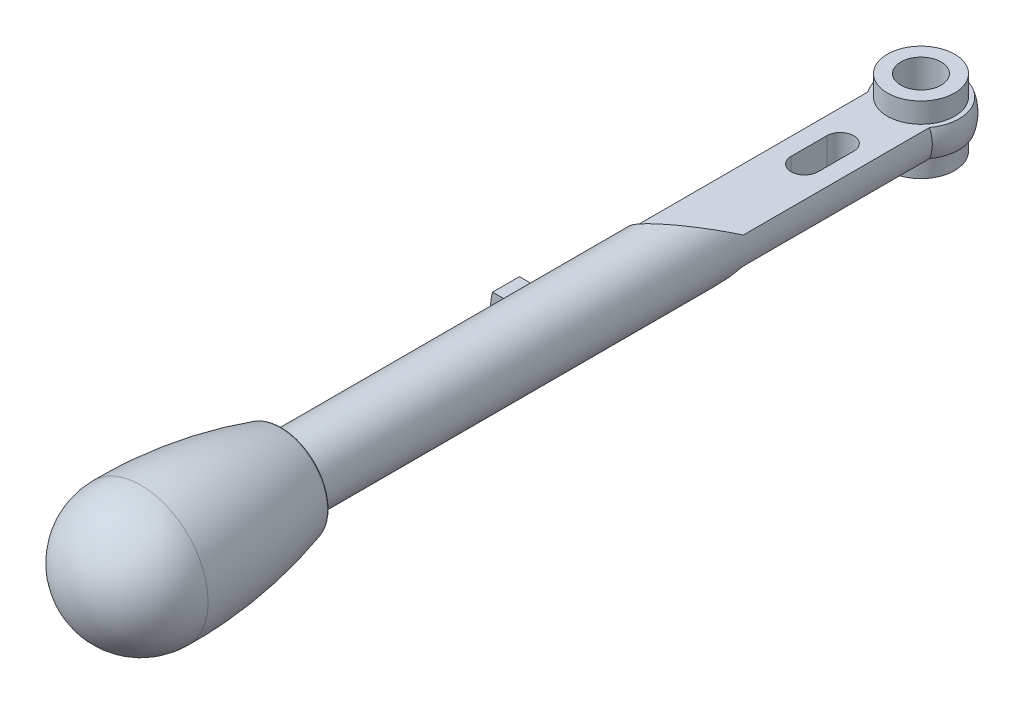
ISO-10303-21;
HEADER;
FILE_DESCRIPTION(('STEP AP214'),'2;1');
FILE_NAME('part.step','',(''),(''),'','','');
FILE_SCHEMA(('AUTOMOTIVE_DESIGN { 1 0 10303 214 1 1 1 1 }'));
ENDSEC;
DATA;
#1=APPLICATION_CONTEXT('core data for automotive mechanical design processes');
#2=APPLICATION_PROTOCOL_DEFINITION('international standard','automotive_design',2000,#1);
#3=PRODUCT_CONTEXT('',#1,'mechanical');
#4=PRODUCT('Part','Part','',(#3));
#5=PRODUCT_RELATED_PRODUCT_CATEGORY('part','',(#4));
#6=PRODUCT_DEFINITION_FORMATION('','',#4);
#7=PRODUCT_DEFINITION_CONTEXT('part definition',#1,'design');
#8=PRODUCT_DEFINITION('design','',#6,#7);
#9=PRODUCT_DEFINITION_SHAPE('','',#8);
#10=(LENGTH_UNIT() NAMED_UNIT(*) SI_UNIT(.MILLI.,.METRE.));
#11=(NAMED_UNIT(*) PLANE_ANGLE_UNIT() SI_UNIT($,.RADIAN.));
#12=(NAMED_UNIT(*) SI_UNIT($,.STERADIAN.) SOLID_ANGLE_UNIT());
#13=UNCERTAINTY_MEASURE_WITH_UNIT(LENGTH_MEASURE(1.E-05),#10,'distance_accuracy_value','');
#14=(GEOMETRIC_REPRESENTATION_CONTEXT(3) GLOBAL_UNCERTAINTY_ASSIGNED_CONTEXT((#13)) GLOBAL_UNIT_ASSIGNED_CONTEXT((#10,
#11,#12)) REPRESENTATION_CONTEXT('',''));
#15=CARTESIAN_POINT('',(0.,0.,0.));
#16=DIRECTION('',(0.,0.,1.));
#17=DIRECTION('',(1.,0.,0.));
#18=AXIS2_PLACEMENT_3D('',#15,#16,#17);
#19=CARTESIAN_POINT('',(5.5927492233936,-3.55678978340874,95.));
#20=DIRECTION('',(0.,0.,1.));
#21=DIRECTION('',(-0.536635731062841,-0.843814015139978,0.));
#22=AXIS2_PLACEMENT_3D('',#19,#20,#21);
#23=PLANE('',#22);
#24=CARTESIAN_POINT('',(0.,0.,95.));
#25=DIRECTION('',(0.,0.,-1.));
#26=DIRECTION('',(0.536635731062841,0.843814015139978,0.));
#27=AXIS2_PLACEMENT_3D('',#24,#25,#26);
#28=CIRCLE('',#27,6.62794066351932);
#29=CARTESIAN_POINT('',(3.55678978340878,5.59274922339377,95.));
#30=VERTEX_POINT('',#29);
#31=EDGE_CURVE('E146',#30,#30,#28,.T.);
#32=ORIENTED_EDGE('',*,*,#31,.T.);
#33=EDGE_LOOP('',(#32));
#34=FACE_BOUND('',#33,.T.);
#35=CARTESIAN_POINT('',(0.,0.,95.));
#36=DIRECTION('',(0.,0.,-1.));
#37=DIRECTION('',(0.,-1.,0.));
#38=AXIS2_PLACEMENT_3D('',#35,#36,#37);
#39=CIRCLE('',#38,5.);
#40=CARTESIAN_POINT('',(0.,-5.,95.));
#41=VERTEX_POINT('',#40);
#42=EDGE_CURVE('E9',#41,#41,#39,.T.);
#43=ORIENTED_EDGE('',*,*,#42,.F.);
#44=EDGE_LOOP('',(#43));
#45=FACE_BOUND('',#44,.T.);
#46=ADVANCED_FACE('F14',(#34,#45),#23,.F.);
#47=CARTESIAN_POINT('',(0.,0.,116.));
#48=DIRECTION('',(0.536635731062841,0.843814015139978,0.));
#49=DIRECTION('',(0.,0.,1.));
#50=AXIS2_PLACEMENT_3D('',#47,#48,#49);
#51=SPHERICAL_SURFACE('',#50,10.);
#52=CARTESIAN_POINT('',(0.,0.,116.));
#53=DIRECTION('',(0.,0.,-1.));
#54=DIRECTION('',(0.536635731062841,0.843814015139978,0.));
#55=AXIS2_PLACEMENT_3D('',#52,#53,#54);
#56=SPHERICAL_SURFACE('',#55,10.);
#57=CARTESIAN_POINT('',(0.,0.,116.));
#58=DIRECTION('',(0.,0.,-1.));
#59=DIRECTION('',(0.536635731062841,0.843814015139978,0.));
#60=AXIS2_PLACEMENT_3D('',#57,#58,#59);
#61=CIRCLE('',#60,10.);
#62=CARTESIAN_POINT('',(5.36635731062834,8.43814015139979,116.));
#63=VERTEX_POINT('',#62);
#64=EDGE_CURVE('E24',#63,#63,#61,.T.);
#65=ORIENTED_EDGE('',*,*,#64,.F.);
#66=EDGE_LOOP('',(#65));
#67=FACE_BOUND('',#66,.T.);
#68=ADVANCED_FACE('F387',(#67),#56,.T.);
#69=CARTESIAN_POINT('',(0.,0.,115.285192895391));
#70=DIRECTION('',(0.,0.,-1.));
#71=DIRECTION('',(0.536635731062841,0.843814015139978,0.));
#72=AXIS2_PLACEMENT_3D('',#69,#70,#71);
#73=DEGENERATE_TOROIDAL_SURFACE('',#72,59.9963502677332,70.,.F.);
#74=CARTESIAN_POINT('',(0.,0.,95.3576604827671));
#75=DIRECTION('',(0.,0.,-1.));
#76=DIRECTION('',(0.536635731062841,0.843814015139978,0.));
#77=AXIS2_PLACEMENT_3D('',#74,#75,#76);
#78=CIRCLE('',#77,7.10725210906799);
#79=CARTESIAN_POINT('',(3.81400543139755,5.99719893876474,95.3576604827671));
#80=VERTEX_POINT('',#79);
#81=EDGE_CURVE('E406',#80,#80,#78,.T.);
#82=ORIENTED_EDGE('',*,*,#81,.F.);
#83=EDGE_LOOP('',(#82));
#84=FACE_BOUND('',#83,.T.);
#85=ORIENTED_EDGE('',*,*,#64,.T.);
#86=EDGE_LOOP('',(#85));
#87=FACE_BOUND('',#86,.T.);
#88=ADVANCED_FACE('F382',(#84,#87),#73,.F.);
#89=CARTESIAN_POINT('',(0.,0.,95.5));
#90=DIRECTION('',(0.,0.,-1.));
#91=DIRECTION('',(0.536635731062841,0.843814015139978,0.));
#92=AXIS2_PLACEMENT_3D('',#89,#90,#91);
#93=TOROIDAL_SURFACE('',#92,6.62794066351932,0.50000000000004);
#94=ORIENTED_EDGE('',*,*,#31,.F.);
#95=EDGE_LOOP('',(#94));
#96=FACE_BOUND('',#95,.T.);
#97=ORIENTED_EDGE('',*,*,#81,.T.);
#98=EDGE_LOOP('',(#97));
#99=FACE_BOUND('',#98,.T.);
#100=ADVANCED_FACE('F323',(#96,#99),#93,.T.);
#101=CARTESIAN_POINT('',(0.,5.,0.));
#102=DIRECTION('',(0.,1.,0.));
#103=DIRECTION('',(0.71733913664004,0.,-0.696724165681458));
#104=AXIS2_PLACEMENT_3D('',#101,#102,#103);
#105=PLANE('',#104);
#106=CARTESIAN_POINT('',(0.,5.,0.));
#107=DIRECTION('',(0.,1.,0.));
#108=DIRECTION('',(0.71733913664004,0.,-0.696724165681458));
#109=AXIS2_PLACEMENT_3D('',#106,#107,#108);
#110=CIRCLE('',#109,5.);
#111=CARTESIAN_POINT('',(3.5866956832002,5.,-3.48362082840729));
#112=VERTEX_POINT('',#111);
#113=EDGE_CURVE('E153',#112,#112,#110,.T.);
#114=ORIENTED_EDGE('',*,*,#113,.T.);
#115=EDGE_LOOP('',(#114));
#116=FACE_BOUND('',#115,.T.);
#117=CARTESIAN_POINT('',(0.,5.,0.));
#118=DIRECTION('',(0.,1.,0.));
#119=DIRECTION('',(-0.159471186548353,0.,0.987202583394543));
#120=AXIS2_PLACEMENT_3D('',#117,#118,#119);
#121=CIRCLE('',#120,3.);
#122=CARTESIAN_POINT('',(-0.478413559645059,5.,2.96160775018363));
#123=VERTEX_POINT('',#122);
#124=EDGE_CURVE('E415',#123,#123,#121,.T.);
#125=ORIENTED_EDGE('',*,*,#124,.F.);
#126=EDGE_LOOP('',(#125));
#127=FACE_BOUND('',#126,.T.);
#128=ADVANCED_FACE('F367',(#116,#127),#105,.T.);
#129=CARTESIAN_POINT('',(0.,-5.,0.));
#130=DIRECTION('',(0.,1.,0.));
#131=DIRECTION('',(0.71733913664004,0.,-0.696724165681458));
#132=AXIS2_PLACEMENT_3D('',#129,#130,#131);
#133=PLANE('',#132);
#134=CARTESIAN_POINT('',(0.,-5.,0.));
#135=DIRECTION('',(0.,1.,0.));
#136=DIRECTION('',(0.71733913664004,0.,-0.696724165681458));
#137=AXIS2_PLACEMENT_3D('',#134,#135,#136);
#138=CIRCLE('',#137,5.);
#139=CARTESIAN_POINT('',(3.5866956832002,-5.,-3.48362082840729));
#140=VERTEX_POINT('',#139);
#141=EDGE_CURVE('E241',#140,#140,#138,.T.);
#142=ORIENTED_EDGE('',*,*,#141,.F.);
#143=EDGE_LOOP('',(#142));
#144=FACE_BOUND('',#143,.T.);
#145=CARTESIAN_POINT('',(0.,-5.,0.));
#146=DIRECTION('',(0.,1.,0.));
#147=DIRECTION('',(-0.159471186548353,0.,0.987202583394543));
#148=AXIS2_PLACEMENT_3D('',#145,#146,#147);
#149=CIRCLE('',#148,3.);
#150=CARTESIAN_POINT('',(-0.478413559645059,-5.,2.96160775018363));
#151=VERTEX_POINT('',#150);
#152=EDGE_CURVE('E244',#151,#151,#149,.F.);
#153=ORIENTED_EDGE('',*,*,#152,.F.);
#154=EDGE_LOOP('',(#153));
#155=FACE_BOUND('',#154,.T.);
#156=ADVANCED_FACE('F341',(#144,#155),#133,.F.);
#157=CARTESIAN_POINT('',(0.,5.,0.));
#158=DIRECTION('',(0.,-1.,0.));
#159=DIRECTION('',(-0.71733913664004,0.,0.696724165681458));
#160=AXIS2_PLACEMENT_3D('',#157,#158,#159);
#161=CYLINDRICAL_SURFACE('',#160,5.);
#162=ORIENTED_EDGE('',*,*,#113,.F.);
#163=EDGE_LOOP('',(#162));
#164=FACE_BOUND('',#163,.T.);
#165=CARTESIAN_POINT('',(0.,2.,0.));
#166=DIRECTION('',(0.,-1.,0.));
#167=DIRECTION('',(0.159471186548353,0.,-0.987202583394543));
#168=AXIS2_PLACEMENT_3D('',#165,#166,#167);
#169=CIRCLE('',#168,5.);
#170=CARTESIAN_POINT('',(0.797355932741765,2.,-4.93601291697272));
#171=VERTEX_POINT('',#170);
#172=EDGE_CURVE('E233',#171,#171,#169,.F.);
#173=ORIENTED_EDGE('',*,*,#172,.T.);
#174=EDGE_LOOP('',(#173));
#175=FACE_BOUND('',#174,.T.);
#176=ADVANCED_FACE('F290',(#164,#175),#161,.T.);
#177=CARTESIAN_POINT('',(0.,-2.,0.));
#178=DIRECTION('',(0.,-1.,0.));
#179=DIRECTION('',(-0.71733913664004,0.,0.696724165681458));
#180=AXIS2_PLACEMENT_3D('',#177,#178,#179);
#181=CYLINDRICAL_SURFACE('',#180,5.);
#182=CARTESIAN_POINT('',(0.,-2.,0.));
#183=DIRECTION('',(0.,1.,0.));
#184=DIRECTION('',(-0.159471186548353,0.,0.987202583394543));
#185=AXIS2_PLACEMENT_3D('',#182,#183,#184);
#186=CIRCLE('',#185,5.);
#187=CARTESIAN_POINT('',(-0.797355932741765,-2.,4.93601291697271));
#188=VERTEX_POINT('',#187);
#189=EDGE_CURVE('E236',#188,#188,#186,.F.);
#190=ORIENTED_EDGE('',*,*,#189,.T.);
#191=EDGE_LOOP('',(#190));
#192=FACE_BOUND('',#191,.T.);
#193=ORIENTED_EDGE('',*,*,#141,.T.);
#194=EDGE_LOOP('',(#193));
#195=FACE_BOUND('',#194,.T.);
#196=ADVANCED_FACE('F16',(#192,#195),#181,.T.);
#197=CARTESIAN_POINT('',(0.,-10.,17.3));
#198=DIRECTION('',(0.,1.,0.));
#199=DIRECTION('',(-1.,0.,0.));
#200=AXIS2_PLACEMENT_3D('',#197,#198,#199);
#201=CYLINDRICAL_SURFACE('',#200,2.);
#202=DIRECTION('',(0.,1.,0.));
#203=VECTOR('',#202,1.);
#204=CARTESIAN_POINT('',(-2.00000000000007,-10.,17.3));
#205=LINE('',#204,#203);
#206=CARTESIAN_POINT('',(-2.00000000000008,-2.,17.3));
#207=VERTEX_POINT('',#206);
#208=CARTESIAN_POINT('',(-2.00000000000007,2.,17.3));
#209=VERTEX_POINT('',#208);
#210=EDGE_CURVE('E107',#207,#209,#205,.T.);
#211=ORIENTED_EDGE('',*,*,#210,.T.);
#212=CARTESIAN_POINT('',(0.,2.,17.3));
#213=DIRECTION('',(0.,-1.,0.));
#214=DIRECTION('',(0.,0.,1.));
#215=AXIS2_PLACEMENT_3D('',#212,#213,#214);
#216=CIRCLE('',#215,2.);
#217=CARTESIAN_POINT('',(2.,2.,17.3));
#218=VERTEX_POINT('',#217);
#219=EDGE_CURVE('E224',#218,#209,#216,.T.);
#220=ORIENTED_EDGE('',*,*,#219,.F.);
#221=DIRECTION('',(0.,1.,0.));
#222=VECTOR('',#221,1.);
#223=CARTESIAN_POINT('',(2.,-10.,17.3));
#224=LINE('',#223,#222);
#225=CARTESIAN_POINT('',(2.,-2.,17.3));
#226=VERTEX_POINT('',#225);
#227=EDGE_CURVE('E186',#226,#218,#224,.T.);
#228=ORIENTED_EDGE('',*,*,#227,.F.);
#229=CARTESIAN_POINT('',(0.,-2.,17.3));
#230=DIRECTION('',(0.,1.,0.));
#231=DIRECTION('',(0.,0.,-1.));
#232=AXIS2_PLACEMENT_3D('',#229,#230,#231);
#233=CIRCLE('',#232,2.);
#234=EDGE_CURVE('E193',#207,#226,#233,.T.);
#235=ORIENTED_EDGE('',*,*,#234,.F.);
#236=EDGE_LOOP('',(#211,#220,#228,#235));
#237=FACE_BOUND('',#236,.T.);
#238=ADVANCED_FACE('F310',(#237),#201,.F.);
#239=CARTESIAN_POINT('',(-2.00000000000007,-10.,17.3));
#240=DIRECTION('',(-1.,0.,0.));
#241=DIRECTION('',(0.,0.,1.));
#242=AXIS2_PLACEMENT_3D('',#239,#240,#241);
#243=PLANE('',#242);
#244=DIRECTION('',(0.,1.,0.));
#245=VECTOR('',#244,1.);
#246=CARTESIAN_POINT('',(-2.00000000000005,-10.,12.));
#247=LINE('',#246,#245);
#248=CARTESIAN_POINT('',(-2.00000000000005,-2.,12.));
#249=VERTEX_POINT('',#248);
#250=CARTESIAN_POINT('',(-2.00000000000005,2.,12.));
#251=VERTEX_POINT('',#250);
#252=EDGE_CURVE('E102',#249,#251,#247,.T.);
#253=ORIENTED_EDGE('',*,*,#252,.T.);
#254=DIRECTION('',(0.,0.,-1.));
#255=VECTOR('',#254,1.);
#256=CARTESIAN_POINT('',(-2.00000000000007,2.,22.));
#257=LINE('',#256,#255);
#258=EDGE_CURVE('E221',#209,#251,#257,.T.);
#259=ORIENTED_EDGE('',*,*,#258,.F.);
#260=ORIENTED_EDGE('',*,*,#210,.F.);
#261=DIRECTION('',(0.,0.,1.));
#262=VECTOR('',#261,1.);
#263=CARTESIAN_POINT('',(-2.00000000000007,-2.,22.));
#264=LINE('',#263,#262);
#265=EDGE_CURVE('E185',#249,#207,#264,.T.);
#266=ORIENTED_EDGE('',*,*,#265,.F.);
#267=EDGE_LOOP('',(#253,#259,#260,#266));
#268=FACE_BOUND('',#267,.T.);
#269=ADVANCED_FACE('F316',(#268),#243,.F.);
#270=CARTESIAN_POINT('',(0.,-10.,12.));
#271=DIRECTION('',(0.,1.,0.));
#272=DIRECTION('',(-1.,0.,0.));
#273=AXIS2_PLACEMENT_3D('',#270,#271,#272);
#274=CYLINDRICAL_SURFACE('',#273,2.);
#275=DIRECTION('',(0.,1.,0.));
#276=VECTOR('',#275,1.);
#277=CARTESIAN_POINT('',(1.99999999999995,-10.,12.));
#278=LINE('',#277,#276);
#279=CARTESIAN_POINT('',(1.99999999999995,-2.,12.));
#280=VERTEX_POINT('',#279);
#281=CARTESIAN_POINT('',(1.99999999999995,2.,12.));
#282=VERTEX_POINT('',#281);
#283=EDGE_CURVE('E182',#280,#282,#278,.T.);
#284=ORIENTED_EDGE('',*,*,#283,.T.);
#285=CARTESIAN_POINT('',(0.,2.,12.));
#286=DIRECTION('',(0.,-1.,0.));
#287=DIRECTION('',(0.,0.,1.));
#288=AXIS2_PLACEMENT_3D('',#285,#286,#287);
#289=CIRCLE('',#288,2.);
#290=EDGE_CURVE('E230',#251,#282,#289,.T.);
#291=ORIENTED_EDGE('',*,*,#290,.F.);
#292=ORIENTED_EDGE('',*,*,#252,.F.);
#293=CARTESIAN_POINT('',(0.,-2.,12.));
#294=DIRECTION('',(0.,1.,0.));
#295=DIRECTION('',(0.,0.,-1.));
#296=AXIS2_PLACEMENT_3D('',#293,#294,#295);
#297=CIRCLE('',#296,2.);
#298=EDGE_CURVE('E199',#280,#249,#297,.T.);
#299=ORIENTED_EDGE('',*,*,#298,.F.);
#300=EDGE_LOOP('',(#284,#291,#292,#299));
#301=FACE_BOUND('',#300,.T.);
#302=ADVANCED_FACE('F326',(#301),#274,.F.);
#303=CARTESIAN_POINT('',(1.99999999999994,-10.,17.3));
#304=DIRECTION('',(1.,0.,0.));
#305=DIRECTION('',(0.,0.,-1.));
#306=AXIS2_PLACEMENT_3D('',#303,#304,#305);
#307=PLANE('',#306);
#308=ORIENTED_EDGE('',*,*,#227,.T.);
#309=DIRECTION('',(0.,0.,1.));
#310=VECTOR('',#309,1.);
#311=CARTESIAN_POINT('',(1.99999999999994,2.,22.));
#312=LINE('',#311,#310);
#313=EDGE_CURVE('E227',#282,#218,#312,.T.);
#314=ORIENTED_EDGE('',*,*,#313,.F.);
#315=ORIENTED_EDGE('',*,*,#283,.F.);
#316=DIRECTION('',(0.,0.,-1.));
#317=VECTOR('',#316,1.);
#318=CARTESIAN_POINT('',(1.99999999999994,-2.,22.));
#319=LINE('',#318,#317);
#320=EDGE_CURVE('E196',#226,#280,#319,.T.);
#321=ORIENTED_EDGE('',*,*,#320,.F.);
#322=EDGE_LOOP('',(#308,#314,#315,#321));
#323=FACE_BOUND('',#322,.T.);
#324=ADVANCED_FACE('F314',(#323),#307,.F.);
#325=CARTESIAN_POINT('',(-15.01685952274,2.,47.4458788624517));
#326=DIRECTION('',(0.454519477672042,-0.707106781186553,0.541675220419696));
#327=DIRECTION('',(0.,0.608120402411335,0.793844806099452));
#328=AXIS2_PLACEMENT_3D('',#325,#326,#327);
#329=PLANE('',#328);
#330=CARTESIAN_POINT('',(0.,0.,32.2344229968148));
#331=DIRECTION('',(0.454519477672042,-0.707106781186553,0.541675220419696));
#332=DIRECTION('',(0.292892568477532,-0.455659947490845,-0.840587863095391));
#333=AXIS2_PLACEMENT_3D('',#330,#331,#332);
#334=ELLIPSE('',#333,9.23062346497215,5.);
#335=CARTESIAN_POINT('',(-4.58257569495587,2.,38.6904751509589));
#336=VERTEX_POINT('',#335);
#337=CARTESIAN_POINT('',(4.58257569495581,2.,31.));
#338=VERTEX_POINT('',#337);
#339=EDGE_CURVE('E156',#336,#338,#334,.F.);
#340=ORIENTED_EDGE('',*,*,#339,.T.);
#341=DIRECTION('',(0.766044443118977,0.,-0.642787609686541));
#342=VECTOR('',#341,1.);
#343=CARTESIAN_POINT('',(4.58257569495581,2.,31.));
#344=LINE('',#343,#342);
#345=EDGE_CURVE('E158',#336,#338,#344,.T.);
#346=ORIENTED_EDGE('',*,*,#345,.F.);
#347=EDGE_LOOP('',(#340,#346));
#348=FACE_BOUND('',#347,.T.);
#349=ADVANCED_FACE('F311',(#348),#329,.F.);
#350=CARTESIAN_POINT('',(10.,2.,22.));
#351=DIRECTION('',(0.,-1.,0.));
#352=DIRECTION('',(0.,0.,1.));
#353=AXIS2_PLACEMENT_3D('',#350,#351,#352);
#354=PLANE('',#353);
#355=DIRECTION('',(0.,0.,-1.));
#356=VECTOR('',#355,1.);
#357=CARTESIAN_POINT('',(4.58257569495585,2.,0.));
#358=LINE('',#357,#356);
#359=CARTESIAN_POINT('',(4.58257569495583,2.,3.3166247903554));
#360=VERTEX_POINT('',#359);
#361=EDGE_CURVE('E216',#338,#360,#358,.T.);
#362=ORIENTED_EDGE('',*,*,#361,.T.);
#363=CARTESIAN_POINT('',(0.,2.,0.));
#364=DIRECTION('',(0.,-1.,0.));
#365=DIRECTION('',(0.,0.,1.));
#366=AXIS2_PLACEMENT_3D('',#363,#364,#365);
#367=CIRCLE('',#366,5.65685424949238);
#368=CARTESIAN_POINT('',(-4.58257569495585,2.,3.31662479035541));
#369=VERTEX_POINT('',#368);
#370=EDGE_CURVE('E202',#360,#369,#367,.F.);
#371=ORIENTED_EDGE('',*,*,#370,.T.);
#372=DIRECTION('',(0.,0.,-1.));
#373=VECTOR('',#372,1.);
#374=CARTESIAN_POINT('',(-4.58257569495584,2.,0.));
#375=LINE('',#374,#373);
#376=EDGE_CURVE('E218',#369,#336,#375,.F.);
#377=ORIENTED_EDGE('',*,*,#376,.T.);
#378=ORIENTED_EDGE('',*,*,#345,.T.);
#379=EDGE_LOOP('',(#362,#371,#377,#378));
#380=FACE_BOUND('',#379,.T.);
#381=ORIENTED_EDGE('',*,*,#258,.T.);
#382=ORIENTED_EDGE('',*,*,#290,.T.);
#383=ORIENTED_EDGE('',*,*,#313,.T.);
#384=ORIENTED_EDGE('',*,*,#219,.T.);
#385=EDGE_LOOP('',(#381,#382,#383,#384));
#386=FACE_BOUND('',#385,.T.);
#387=ORIENTED_EDGE('',*,*,#172,.F.);
#388=EDGE_LOOP('',(#387));
#389=FACE_BOUND('',#388,.T.);
#390=ADVANCED_FACE('F313',(#380,#386,#389),#354,.F.);
#391=CARTESIAN_POINT('',(0.,0.,0.));
#392=DIRECTION('',(0.,0.,-1.));
#393=DIRECTION('',(1.,0.,0.));
#394=AXIS2_PLACEMENT_3D('',#391,#392,#393);
#395=SPHERICAL_SURFACE('',#394,6.);
#396=ORIENTED_EDGE('',*,*,#370,.F.);
#397=CARTESIAN_POINT('',(0.,0.,3.3166247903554));
#398=DIRECTION('',(0.,0.,-1.));
#399=DIRECTION('',(0.,-1.,0.));
#400=AXIS2_PLACEMENT_3D('',#397,#398,#399);
#401=CIRCLE('',#400,5.);
#402=CARTESIAN_POINT('',(4.58257569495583,-2.,3.3166247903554));
#403=VERTEX_POINT('',#402);
#404=EDGE_CURVE('E207',#360,#403,#401,.T.);
#405=ORIENTED_EDGE('',*,*,#404,.T.);
#406=CARTESIAN_POINT('',(0.,-2.,0.));
#407=DIRECTION('',(0.,1.,0.));
#408=DIRECTION('',(0.,0.,-1.));
#409=AXIS2_PLACEMENT_3D('',#406,#407,#408);
#410=CIRCLE('',#409,5.65685424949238);
#411=CARTESIAN_POINT('',(-4.58257569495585,-2.,3.31662479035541));
#412=VERTEX_POINT('',#411);
#413=EDGE_CURVE('E204',#412,#403,#410,.F.);
#414=ORIENTED_EDGE('',*,*,#413,.F.);
#415=EDGE_CURVE('E208',#412,#369,#401,.T.);
#416=ORIENTED_EDGE('',*,*,#415,.T.);
#417=EDGE_LOOP('',(#396,#405,#414,#416));
#418=FACE_BOUND('',#417,.T.);
#419=ADVANCED_FACE('F308',(#418),#395,.T.);
#420=CARTESIAN_POINT('',(-15.01685952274,-2.,47.4458788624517));
#421=DIRECTION('',(-0.454519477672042,-0.707106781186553,-0.541675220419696));
#422=DIRECTION('',(0.,-0.608120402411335,0.793844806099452));
#423=AXIS2_PLACEMENT_3D('',#420,#421,#422);
#424=PLANE('',#423);
#425=DIRECTION('',(0.766044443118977,0.,-0.642787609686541));
#426=VECTOR('',#425,1.);
#427=CARTESIAN_POINT('',(4.58257569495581,-2.,31.));
#428=LINE('',#427,#426);
#429=CARTESIAN_POINT('',(-4.58257569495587,-2.,38.6904751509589));
#430=VERTEX_POINT('',#429);
#431=CARTESIAN_POINT('',(4.58257569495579,-2.,31.));
#432=VERTEX_POINT('',#431);
#433=EDGE_CURVE('E152',#430,#432,#428,.T.);
#434=ORIENTED_EDGE('',*,*,#433,.T.);
#435=CARTESIAN_POINT('',(0.,0.,32.2344229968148));
#436=DIRECTION('',(-0.454519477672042,-0.707106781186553,-0.541675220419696));
#437=DIRECTION('',(0.292892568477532,0.455659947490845,-0.840587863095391));
#438=AXIS2_PLACEMENT_3D('',#435,#436,#437);
#439=ELLIPSE('',#438,9.23062346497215,5.);
#440=EDGE_CURVE('E150',#430,#432,#439,.F.);
#441=ORIENTED_EDGE('',*,*,#440,.F.);
#442=EDGE_LOOP('',(#434,#441));
#443=FACE_BOUND('',#442,.T.);
#444=ADVANCED_FACE('F285',(#443),#424,.T.);
#445=CARTESIAN_POINT('',(10.,-2.,22.));
#446=DIRECTION('',(0.,1.,0.));
#447=DIRECTION('',(0.,0.,-1.));
#448=AXIS2_PLACEMENT_3D('',#445,#446,#447);
#449=PLANE('',#448);
#450=ORIENTED_EDGE('',*,*,#320,.T.);
#451=ORIENTED_EDGE('',*,*,#298,.T.);
#452=ORIENTED_EDGE('',*,*,#265,.T.);
#453=ORIENTED_EDGE('',*,*,#234,.T.);
#454=EDGE_LOOP('',(#450,#451,#452,#453));
#455=FACE_BOUND('',#454,.T.);
#456=DIRECTION('',(0.,0.,-1.));
#457=VECTOR('',#456,1.);
#458=CARTESIAN_POINT('',(4.58257569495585,-2.,0.));
#459=LINE('',#458,#457);
#460=EDGE_CURVE('E213',#403,#432,#459,.F.);
#461=ORIENTED_EDGE('',*,*,#460,.T.);
#462=ORIENTED_EDGE('',*,*,#433,.F.);
#463=DIRECTION('',(0.,0.,-1.));
#464=VECTOR('',#463,1.);
#465=CARTESIAN_POINT('',(-4.58257569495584,-2.,0.));
#466=LINE('',#465,#464);
#467=EDGE_CURVE('E211',#430,#412,#466,.T.);
#468=ORIENTED_EDGE('',*,*,#467,.T.);
#469=ORIENTED_EDGE('',*,*,#413,.T.);
#470=EDGE_LOOP('',(#461,#462,#468,#469));
#471=FACE_BOUND('',#470,.T.);
#472=ORIENTED_EDGE('',*,*,#189,.F.);
#473=EDGE_LOOP('',(#472));
#474=FACE_BOUND('',#473,.T.);
#475=ADVANCED_FACE('F307',(#455,#471,#474),#449,.F.);
#476=CARTESIAN_POINT('',(-3.53553390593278,-3.53553390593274,53.));
#477=DIRECTION('',(0.,0.,-1.));
#478=DIRECTION('',(0.,-1.,0.));
#479=AXIS2_PLACEMENT_3D('',#476,#477,#478);
#480=PLANE('',#479);
#481=DIRECTION('',(1.,0.,0.));
#482=VECTOR('',#481,1.);
#483=CARTESIAN_POINT('',(-3.53553390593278,-2.,53.));
#484=LINE('',#483,#482);
#485=CARTESIAN_POINT('',(-6.70820393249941,-2.,53.));
#486=VERTEX_POINT('',#485);
#487=CARTESIAN_POINT('',(-4.58257569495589,-2.,53.));
#488=VERTEX_POINT('',#487);
#489=EDGE_CURVE('E165',#486,#488,#484,.T.);
#490=ORIENTED_EDGE('',*,*,#489,.F.);
#491=CARTESIAN_POINT('',(0.,0.,53.));
#492=DIRECTION('',(0.,0.,-1.));
#493=DIRECTION('',(0.,-1.,0.));
#494=AXIS2_PLACEMENT_3D('',#491,#492,#493);
#495=CIRCLE('',#494,7.);
#496=CARTESIAN_POINT('',(-6.70820393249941,2.,53.));
#497=VERTEX_POINT('',#496);
#498=EDGE_CURVE('E178',#486,#497,#495,.T.);
#499=ORIENTED_EDGE('',*,*,#498,.T.);
#500=DIRECTION('',(-1.,0.,0.));
#501=VECTOR('',#500,1.);
#502=CARTESIAN_POINT('',(-3.53553390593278,2.,53.));
#503=LINE('',#502,#501);
#504=CARTESIAN_POINT('',(-4.58257569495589,2.,53.));
#505=VERTEX_POINT('',#504);
#506=EDGE_CURVE('E173',#505,#497,#503,.T.);
#507=ORIENTED_EDGE('',*,*,#506,.F.);
#508=CARTESIAN_POINT('',(0.,0.,53.));
#509=DIRECTION('',(0.,0.,-1.));
#510=DIRECTION('',(0.,-1.,0.));
#511=AXIS2_PLACEMENT_3D('',#508,#509,#510);
#512=CIRCLE('',#511,5.);
#513=EDGE_CURVE('E180',#488,#505,#512,.T.);
#514=ORIENTED_EDGE('',*,*,#513,.F.);
#515=EDGE_LOOP('',(#490,#499,#507,#514));
#516=FACE_BOUND('',#515,.T.);
#517=ADVANCED_FACE('F264',(#516),#480,.T.);
#518=CARTESIAN_POINT('',(0.,0.,0.));
#519=DIRECTION('',(0.,0.,-1.));
#520=DIRECTION('',(0.,-1.,0.));
#521=AXIS2_PLACEMENT_3D('',#518,#519,#520);
#522=CYLINDRICAL_SURFACE('',#521,7.);
#523=DIRECTION('',(0.,0.,1.));
#524=VECTOR('',#523,1.);
#525=CARTESIAN_POINT('',(-6.70820393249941,-2.,50.));
#526=LINE('',#525,#524);
#527=CARTESIAN_POINT('',(-6.70820393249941,-2.,57.));
#528=VERTEX_POINT('',#527);
#529=EDGE_CURVE('E162',#486,#528,#526,.T.);
#530=ORIENTED_EDGE('',*,*,#529,.T.);
#531=CARTESIAN_POINT('',(0.,0.,57.));
#532=DIRECTION('',(0.,0.,-1.));
#533=DIRECTION('',(0.,-1.,0.));
#534=AXIS2_PLACEMENT_3D('',#531,#532,#533);
#535=CIRCLE('',#534,7.);
#536=CARTESIAN_POINT('',(-6.70820393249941,2.,57.));
#537=VERTEX_POINT('',#536);
#538=EDGE_CURVE('E176',#528,#537,#535,.T.);
#539=ORIENTED_EDGE('',*,*,#538,.T.);
#540=DIRECTION('',(0.,0.,1.));
#541=VECTOR('',#540,1.);
#542=CARTESIAN_POINT('',(-6.70820393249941,2.,50.));
#543=LINE('',#542,#541);
#544=EDGE_CURVE('E169',#497,#537,#543,.T.);
#545=ORIENTED_EDGE('',*,*,#544,.F.);
#546=ORIENTED_EDGE('',*,*,#498,.F.);
#547=EDGE_LOOP('',(#530,#539,#545,#546));
#548=FACE_BOUND('',#547,.T.);
#549=ADVANCED_FACE('F270',(#548),#522,.T.);
#550=CARTESIAN_POINT('',(-4.58257569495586,2.,50.));
#551=DIRECTION('',(0.,-1.,0.));
#552=DIRECTION('',(1.,0.,0.));
#553=AXIS2_PLACEMENT_3D('',#550,#551,#552);
#554=PLANE('',#553);
#555=ORIENTED_EDGE('',*,*,#506,.T.);
#556=ORIENTED_EDGE('',*,*,#544,.T.);
#557=DIRECTION('',(1.,0.,0.));
#558=VECTOR('',#557,1.);
#559=CARTESIAN_POINT('',(-4.58257569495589,2.,57.));
#560=LINE('',#559,#558);
#561=CARTESIAN_POINT('',(-4.58257569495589,2.,57.));
#562=VERTEX_POINT('',#561);
#563=EDGE_CURVE('E168',#537,#562,#560,.T.);
#564=ORIENTED_EDGE('',*,*,#563,.T.);
#565=DIRECTION('',(0.,0.,1.));
#566=VECTOR('',#565,1.);
#567=CARTESIAN_POINT('',(-4.58257569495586,2.,50.));
#568=LINE('',#567,#566);
#569=EDGE_CURVE('E172',#505,#562,#568,.T.);
#570=ORIENTED_EDGE('',*,*,#569,.F.);
#571=EDGE_LOOP('',(#555,#556,#564,#570));
#572=FACE_BOUND('',#571,.T.);
#573=ADVANCED_FACE('F268',(#572),#554,.F.);
#574=CARTESIAN_POINT('',(-4.58257569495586,-2.,50.));
#575=DIRECTION('',(0.,1.,0.));
#576=DIRECTION('',(-1.,0.,0.));
#577=AXIS2_PLACEMENT_3D('',#574,#575,#576);
#578=PLANE('',#577);
#579=ORIENTED_EDGE('',*,*,#489,.T.);
#580=DIRECTION('',(0.,0.,1.));
#581=VECTOR('',#580,1.);
#582=CARTESIAN_POINT('',(-4.58257569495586,-2.,50.));
#583=LINE('',#582,#581);
#584=CARTESIAN_POINT('',(-4.58257569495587,-2.,57.));
#585=VERTEX_POINT('',#584);
#586=EDGE_CURVE('E166',#488,#585,#583,.T.);
#587=ORIENTED_EDGE('',*,*,#586,.T.);
#588=DIRECTION('',(-1.,0.,0.));
#589=VECTOR('',#588,1.);
#590=CARTESIAN_POINT('',(-4.58257569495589,-2.,57.));
#591=LINE('',#590,#589);
#592=EDGE_CURVE('E161',#585,#528,#591,.T.);
#593=ORIENTED_EDGE('',*,*,#592,.T.);
#594=ORIENTED_EDGE('',*,*,#529,.F.);
#595=EDGE_LOOP('',(#579,#587,#593,#594));
#596=FACE_BOUND('',#595,.T.);
#597=ADVANCED_FACE('F257',(#596),#578,.F.);
#598=CARTESIAN_POINT('',(0.,0.,57.));
#599=DIRECTION('',(0.,0.,1.));
#600=DIRECTION('',(0.,1.,0.));
#601=AXIS2_PLACEMENT_3D('',#598,#599,#600);
#602=PLANE('',#601);
#603=ORIENTED_EDGE('',*,*,#592,.F.);
#604=CARTESIAN_POINT('',(0.,0.,57.));
#605=DIRECTION('',(0.,0.,-1.));
#606=DIRECTION('',(0.,-1.,0.));
#607=AXIS2_PLACEMENT_3D('',#604,#605,#606);
#608=CIRCLE('',#607,5.);
#609=EDGE_CURVE('E33',#585,#562,#608,.T.);
#610=ORIENTED_EDGE('',*,*,#609,.T.);
#611=ORIENTED_EDGE('',*,*,#563,.F.);
#612=ORIENTED_EDGE('',*,*,#538,.F.);
#613=EDGE_LOOP('',(#603,#610,#611,#612));
#614=FACE_BOUND('',#613,.T.);
#615=ADVANCED_FACE('F272',(#614),#602,.T.);
#616=CARTESIAN_POINT('',(-7.,5.,72.));
#617=DIRECTION('',(0.,0.,-1.));
#618=DIRECTION('',(0.,-1.,0.));
#619=AXIS2_PLACEMENT_3D('',#616,#617,#618);
#620=PLANE('',#619);
#621=DIRECTION('',(0.,-1.,0.));
#622=VECTOR('',#621,1.);
#623=CARTESIAN_POINT('',(-4.00000000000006,5.,72.));
#624=LINE('',#623,#622);
#625=CARTESIAN_POINT('',(-4.00000000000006,3.,72.));
#626=VERTEX_POINT('',#625);
#627=CARTESIAN_POINT('',(-4.00000000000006,-3.,72.));
#628=VERTEX_POINT('',#627);
#629=EDGE_CURVE('E131',#626,#628,#624,.T.);
#630=ORIENTED_EDGE('',*,*,#629,.F.);
#631=CARTESIAN_POINT('',(0.,0.,72.));
#632=DIRECTION('',(0.,0.,-1.));
#633=DIRECTION('',(0.,-1.,0.));
#634=AXIS2_PLACEMENT_3D('',#631,#632,#633);
#635=CIRCLE('',#634,5.);
#636=EDGE_CURVE('E136',#628,#626,#635,.T.);
#637=ORIENTED_EDGE('',*,*,#636,.F.);
#638=EDGE_LOOP('',(#630,#637));
#639=FACE_BOUND('',#638,.T.);
#640=ADVANCED_FACE('F274',(#639),#620,.F.);
#641=CARTESIAN_POINT('',(-4.00000000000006,5.,72.));
#642=DIRECTION('',(1.,0.,0.));
#643=DIRECTION('',(0.,0.,1.));
#644=AXIS2_PLACEMENT_3D('',#641,#642,#643);
#645=PLANE('',#644);
#646=DIRECTION('',(0.,-1.,0.));
#647=VECTOR('',#646,1.);
#648=CARTESIAN_POINT('',(-4.00000000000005,5.,80.));
#649=LINE('',#648,#647);
#650=CARTESIAN_POINT('',(-4.,3.,80.));
#651=VERTEX_POINT('',#650);
#652=CARTESIAN_POINT('',(-4.00000000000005,-3.,80.));
#653=VERTEX_POINT('',#652);
#654=EDGE_CURVE('E124',#651,#653,#649,.T.);
#655=ORIENTED_EDGE('',*,*,#654,.F.);
#656=DIRECTION('',(0.,0.,-1.));
#657=VECTOR('',#656,1.);
#658=CARTESIAN_POINT('',(-4.00000000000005,3.,57.));
#659=LINE('',#658,#657);
#660=EDGE_CURVE('E116',#626,#651,#659,.F.);
#661=ORIENTED_EDGE('',*,*,#660,.F.);
#662=ORIENTED_EDGE('',*,*,#629,.T.);
#663=DIRECTION('',(0.,0.,-1.));
#664=VECTOR('',#663,1.);
#665=CARTESIAN_POINT('',(-4.00000000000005,-3.,57.));
#666=LINE('',#665,#664);
#667=EDGE_CURVE('E128',#653,#628,#666,.T.);
#668=ORIENTED_EDGE('',*,*,#667,.F.);
#669=EDGE_LOOP('',(#655,#661,#662,#668));
#670=FACE_BOUND('',#669,.T.);
#671=ADVANCED_FACE('F126',(#670),#645,.F.);
#672=CARTESIAN_POINT('',(-7.,5.,80.));
#673=DIRECTION('',(0.,0.,1.));
#674=DIRECTION('',(0.,1.,0.));
#675=AXIS2_PLACEMENT_3D('',#672,#673,#674);
#676=PLANE('',#675);
#677=ORIENTED_EDGE('',*,*,#654,.T.);
#678=CARTESIAN_POINT('',(0.,0.,80.));
#679=DIRECTION('',(0.,0.,1.));
#680=DIRECTION('',(0.,1.,0.));
#681=AXIS2_PLACEMENT_3D('',#678,#679,#680);
#682=CIRCLE('',#681,5.);
#683=EDGE_CURVE('E133',#651,#653,#682,.T.);
#684=ORIENTED_EDGE('',*,*,#683,.F.);
#685=EDGE_LOOP('',(#677,#684));
#686=FACE_BOUND('',#685,.T.);
#687=ADVANCED_FACE('F134',(#686),#676,.F.);
#688=CARTESIAN_POINT('',(0.,0.,57.));
#689=DIRECTION('',(0.,0.,-1.));
#690=DIRECTION('',(0.,-1.,0.));
#691=AXIS2_PLACEMENT_3D('',#688,#689,#690);
#692=CYLINDRICAL_SURFACE('',#691,5.);
#693=ORIENTED_EDGE('',*,*,#683,.T.);
#694=ORIENTED_EDGE('',*,*,#667,.T.);
#695=ORIENTED_EDGE('',*,*,#636,.T.);
#696=ORIENTED_EDGE('',*,*,#660,.T.);
#697=EDGE_LOOP('',(#693,#694,#695,#696));
#698=FACE_BOUND('',#697,.T.);
#699=ORIENTED_EDGE('',*,*,#609,.F.);
#700=ORIENTED_EDGE('',*,*,#586,.F.);
#701=ORIENTED_EDGE('',*,*,#513,.T.);
#702=ORIENTED_EDGE('',*,*,#569,.T.);
#703=EDGE_LOOP('',(#699,#700,#701,#702));
#704=FACE_BOUND('',#703,.T.);
#705=ORIENTED_EDGE('',*,*,#42,.T.);
#706=EDGE_LOOP('',(#705));
#707=FACE_BOUND('',#706,.T.);
#708=ORIENTED_EDGE('',*,*,#467,.F.);
#709=ORIENTED_EDGE('',*,*,#440,.T.);
#710=ORIENTED_EDGE('',*,*,#460,.F.);
#711=ORIENTED_EDGE('',*,*,#404,.F.);
#712=ORIENTED_EDGE('',*,*,#361,.F.);
#713=ORIENTED_EDGE('',*,*,#339,.F.);
#714=ORIENTED_EDGE('',*,*,#376,.F.);
#715=ORIENTED_EDGE('',*,*,#415,.F.);
#716=EDGE_LOOP('',(#708,#709,#710,#711,#712,#713,#714,#715));
#717=FACE_BOUND('',#716,.T.);
#718=ADVANCED_FACE('F139',(#698,#704,#707,#717),#692,.T.);
#719=CARTESIAN_POINT('',(0.,-5.,0.));
#720=DIRECTION('',(0.,1.,0.));
#721=DIRECTION('',(-1.,0.,0.));
#722=AXIS2_PLACEMENT_3D('',#719,#720,#721);
#723=CYLINDRICAL_SURFACE('',#722,3.);
#724=ORIENTED_EDGE('',*,*,#152,.T.);
#725=EDGE_LOOP('',(#724));
#726=FACE_BOUND('',#725,.T.);
#727=ORIENTED_EDGE('',*,*,#124,.T.);
#728=EDGE_LOOP('',(#727));
#729=FACE_BOUND('',#728,.T.);
#730=ADVANCED_FACE('F304',(#726,#729),#723,.F.);
#731=CLOSED_SHELL('',(#46,#68,#88,#100,#128,#156,#176,#196,#238,#269,#302,#324,#349,#390,#419,
#444,#475,#517,#549,#573,#597,#615,#640,#671,#687,#718,#730));
#732=MANIFOLD_SOLID_BREP('B1',#731);
#733=ADVANCED_BREP_SHAPE_REPRESENTATION('',(#18,#732),#14);
#734=SHAPE_DEFINITION_REPRESENTATION(#9,#733);
ENDSEC;
END-ISO-10303-21;
